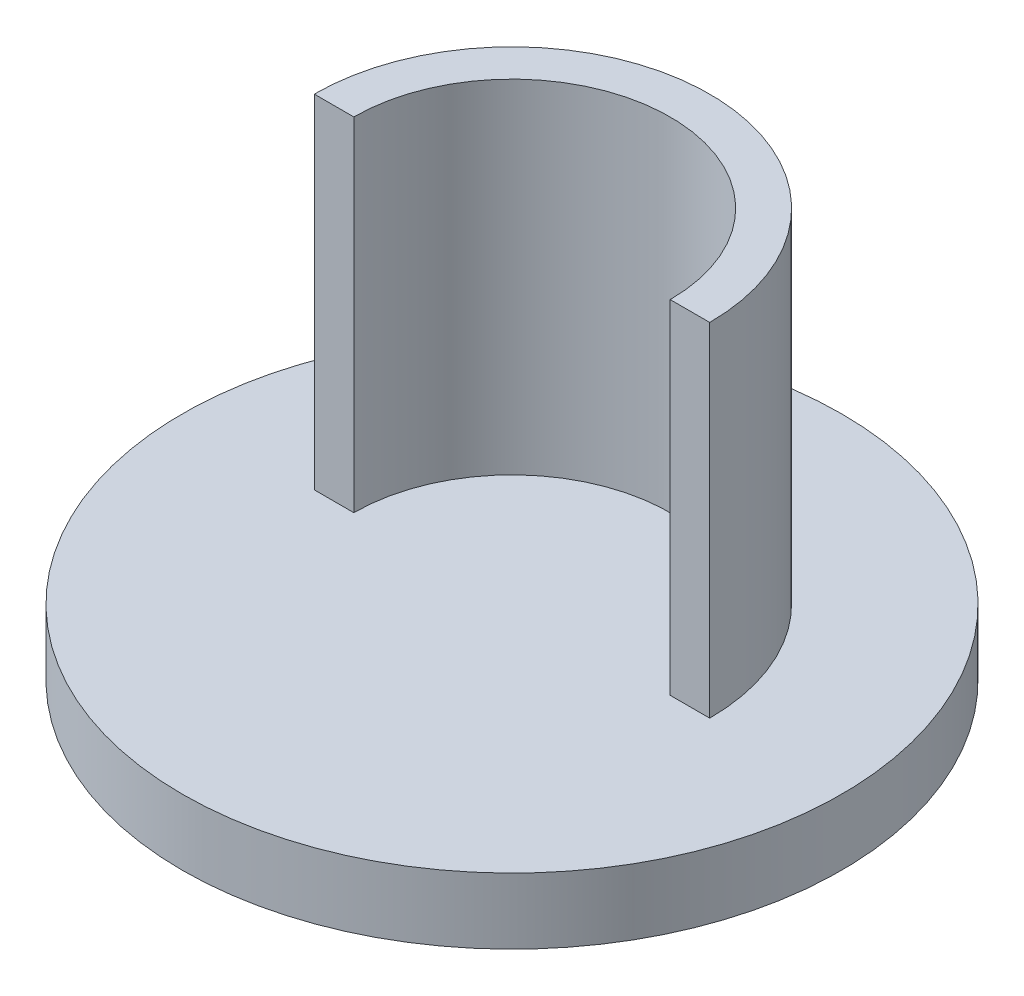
ISO-10303-21;
HEADER;
FILE_DESCRIPTION(('STEP AP214'),'2;1');
FILE_NAME('part.step','',(''),(''),'','','');
FILE_SCHEMA(('AUTOMOTIVE_DESIGN { 1 0 10303 214 1 1 1 1 }'));
ENDSEC;
DATA;
#1=APPLICATION_CONTEXT('core data for automotive mechanical design processes');
#2=APPLICATION_PROTOCOL_DEFINITION('international standard','automotive_design',2000,#1);
#3=PRODUCT_CONTEXT('',#1,'mechanical');
#4=PRODUCT('Part','Part','',(#3));
#5=PRODUCT_RELATED_PRODUCT_CATEGORY('part','',(#4));
#6=PRODUCT_DEFINITION_FORMATION('','',#4);
#7=PRODUCT_DEFINITION_CONTEXT('part definition',#1,'design');
#8=PRODUCT_DEFINITION('design','',#6,#7);
#9=PRODUCT_DEFINITION_SHAPE('','',#8);
#10=(LENGTH_UNIT() NAMED_UNIT(*) SI_UNIT(.MILLI.,.METRE.));
#11=(NAMED_UNIT(*) PLANE_ANGLE_UNIT() SI_UNIT($,.RADIAN.));
#12=(NAMED_UNIT(*) SI_UNIT($,.STERADIAN.) SOLID_ANGLE_UNIT());
#13=UNCERTAINTY_MEASURE_WITH_UNIT(LENGTH_MEASURE(1.E-05),#10,'distance_accuracy_value','');
#14=(GEOMETRIC_REPRESENTATION_CONTEXT(3) GLOBAL_UNCERTAINTY_ASSIGNED_CONTEXT((#13)) GLOBAL_UNIT_ASSIGNED_CONTEXT((#10,
#11,#12)) REPRESENTATION_CONTEXT('',''));
#15=CARTESIAN_POINT('',(0.,0.,0.));
#16=DIRECTION('',(0.,0.,1.));
#17=DIRECTION('',(1.,0.,0.));
#18=AXIS2_PLACEMENT_3D('',#15,#16,#17);
#19=CARTESIAN_POINT('',(0.,5.,0.));
#20=DIRECTION('',(0.,1.,0.));
#21=DIRECTION('',(0.,0.,1.));
#22=AXIS2_PLACEMENT_3D('',#19,#20,#21);
#23=PLANE('',#22);
#24=CARTESIAN_POINT('',(0.,5.,0.));
#25=DIRECTION('',(0.,1.,0.));
#26=DIRECTION('',(0.,0.,1.));
#27=AXIS2_PLACEMENT_3D('',#24,#25,#26);
#28=CIRCLE('',#27,25.);
#29=CARTESIAN_POINT('',(0.,5.,25.));
#30=VERTEX_POINT('',#29);
#31=EDGE_CURVE('E11',#30,#30,#28,.T.);
#32=ORIENTED_EDGE('',*,*,#31,.T.);
#33=EDGE_LOOP('',(#32));
#34=FACE_BOUND('',#33,.T.);
#35=DIRECTION('',(-1.,0.,0.));
#36=VECTOR('',#35,1.);
#37=CARTESIAN_POINT('',(15.,5.,0.));
#38=LINE('',#37,#36);
#39=CARTESIAN_POINT('',(15.,5.,0.));
#40=VERTEX_POINT('',#39);
#41=CARTESIAN_POINT('',(12.,5.,0.));
#42=VERTEX_POINT('',#41);
#43=EDGE_CURVE('E48',#40,#42,#38,.T.);
#44=ORIENTED_EDGE('',*,*,#43,.T.);
#45=CARTESIAN_POINT('',(0.,5.,0.));
#46=DIRECTION('',(0.,1.,0.));
#47=DIRECTION('',(-1.,0.,0.));
#48=AXIS2_PLACEMENT_3D('',#45,#46,#47);
#49=CIRCLE('',#48,12.);
#50=CARTESIAN_POINT('',(-12.,5.,0.));
#51=VERTEX_POINT('',#50);
#52=EDGE_CURVE('E71',#51,#42,#49,.F.);
#53=ORIENTED_EDGE('',*,*,#52,.F.);
#54=DIRECTION('',(-1.,0.,0.));
#55=VECTOR('',#54,1.);
#56=CARTESIAN_POINT('',(-12.,5.,0.));
#57=LINE('',#56,#55);
#58=CARTESIAN_POINT('',(-15.,5.,0.));
#59=VERTEX_POINT('',#58);
#60=EDGE_CURVE('E74',#51,#59,#57,.T.);
#61=ORIENTED_EDGE('',*,*,#60,.T.);
#62=CARTESIAN_POINT('',(0.,5.,0.));
#63=DIRECTION('',(0.,-1.,0.));
#64=DIRECTION('',(0.,0.,-1.));
#65=AXIS2_PLACEMENT_3D('',#62,#63,#64);
#66=CIRCLE('',#65,15.);
#67=EDGE_CURVE('E53',#59,#40,#66,.T.);
#68=ORIENTED_EDGE('',*,*,#67,.T.);
#69=EDGE_LOOP('',(#44,#53,#61,#68));
#70=FACE_BOUND('',#69,.T.);
#71=ADVANCED_FACE('F33',(#34,#70),#23,.T.);
#72=CARTESIAN_POINT('',(0.,5.,0.));
#73=DIRECTION('',(0.,-1.,0.));
#74=DIRECTION('',(0.,0.,-1.));
#75=AXIS2_PLACEMENT_3D('',#72,#73,#74);
#76=CYLINDRICAL_SURFACE('',#75,25.);
#77=ORIENTED_EDGE('',*,*,#31,.F.);
#78=EDGE_LOOP('',(#77));
#79=FACE_BOUND('',#78,.T.);
#80=CARTESIAN_POINT('',(0.,0.,0.));
#81=DIRECTION('',(0.,1.,0.));
#82=DIRECTION('',(0.,0.,1.));
#83=AXIS2_PLACEMENT_3D('',#80,#81,#82);
#84=CIRCLE('',#83,25.);
#85=CARTESIAN_POINT('',(0.,0.,25.));
#86=VERTEX_POINT('',#85);
#87=EDGE_CURVE('E41',#86,#86,#84,.T.);
#88=ORIENTED_EDGE('',*,*,#87,.T.);
#89=EDGE_LOOP('',(#88));
#90=FACE_BOUND('',#89,.T.);
#91=ADVANCED_FACE('F35',(#79,#90),#76,.T.);
#92=CARTESIAN_POINT('',(0.,0.,0.));
#93=DIRECTION('',(0.,1.,0.));
#94=DIRECTION('',(0.,0.,1.));
#95=AXIS2_PLACEMENT_3D('',#92,#93,#94);
#96=PLANE('',#95);
#97=ORIENTED_EDGE('',*,*,#87,.F.);
#98=EDGE_LOOP('',(#97));
#99=FACE_BOUND('',#98,.T.);
#100=ADVANCED_FACE('F110',(#99),#96,.F.);
#101=CARTESIAN_POINT('',(0.,31.,0.));
#102=DIRECTION('',(0.,-1.,0.));
#103=DIRECTION('',(0.,0.,-1.));
#104=AXIS2_PLACEMENT_3D('',#101,#102,#103);
#105=CYLINDRICAL_SURFACE('',#104,12.);
#106=ORIENTED_EDGE('',*,*,#52,.T.);
#107=DIRECTION('',(0.,-1.,0.));
#108=VECTOR('',#107,1.);
#109=CARTESIAN_POINT('',(12.,31.,0.));
#110=LINE('',#109,#108);
#111=CARTESIAN_POINT('',(12.,31.,0.));
#112=VERTEX_POINT('',#111);
#113=EDGE_CURVE('E105',#112,#42,#110,.T.);
#114=ORIENTED_EDGE('',*,*,#113,.F.);
#115=CARTESIAN_POINT('',(0.,31.,0.));
#116=DIRECTION('',(0.,1.,0.));
#117=DIRECTION('',(-1.,0.,0.));
#118=AXIS2_PLACEMENT_3D('',#115,#116,#117);
#119=CIRCLE('',#118,12.);
#120=CARTESIAN_POINT('',(-12.,31.,0.));
#121=VERTEX_POINT('',#120);
#122=EDGE_CURVE('E82',#121,#112,#119,.F.);
#123=ORIENTED_EDGE('',*,*,#122,.F.);
#124=DIRECTION('',(0.,-1.,0.));
#125=VECTOR('',#124,1.);
#126=CARTESIAN_POINT('',(-12.,31.,0.));
#127=LINE('',#126,#125);
#128=EDGE_CURVE('E80',#121,#51,#127,.T.);
#129=ORIENTED_EDGE('',*,*,#128,.T.);
#130=EDGE_LOOP('',(#106,#114,#123,#129));
#131=FACE_BOUND('',#130,.T.);
#132=ADVANCED_FACE('F81',(#131),#105,.F.);
#133=CARTESIAN_POINT('',(15.,31.,0.));
#134=DIRECTION('',(0.,0.,1.));
#135=DIRECTION('',(1.,0.,0.));
#136=AXIS2_PLACEMENT_3D('',#133,#134,#135);
#137=PLANE('',#136);
#138=ORIENTED_EDGE('',*,*,#43,.F.);
#139=DIRECTION('',(0.,-1.,0.));
#140=VECTOR('',#139,1.);
#141=CARTESIAN_POINT('',(15.,31.,0.));
#142=LINE('',#141,#140);
#143=CARTESIAN_POINT('',(15.,31.,0.));
#144=VERTEX_POINT('',#143);
#145=EDGE_CURVE('E103',#144,#40,#142,.T.);
#146=ORIENTED_EDGE('',*,*,#145,.F.);
#147=DIRECTION('',(-1.,0.,0.));
#148=VECTOR('',#147,1.);
#149=CARTESIAN_POINT('',(15.,31.,0.));
#150=LINE('',#149,#148);
#151=EDGE_CURVE('E91',#144,#112,#150,.T.);
#152=ORIENTED_EDGE('',*,*,#151,.T.);
#153=ORIENTED_EDGE('',*,*,#113,.T.);
#154=EDGE_LOOP('',(#138,#146,#152,#153));
#155=FACE_BOUND('',#154,.T.);
#156=ADVANCED_FACE('F117',(#155),#137,.T.);
#157=CARTESIAN_POINT('',(0.,31.,0.));
#158=DIRECTION('',(0.,-1.,0.));
#159=DIRECTION('',(0.,0.,-1.));
#160=AXIS2_PLACEMENT_3D('',#157,#158,#159);
#161=CYLINDRICAL_SURFACE('',#160,15.);
#162=ORIENTED_EDGE('',*,*,#67,.F.);
#163=DIRECTION('',(0.,-1.,0.));
#164=VECTOR('',#163,1.);
#165=CARTESIAN_POINT('',(-15.,31.,0.));
#166=LINE('',#165,#164);
#167=CARTESIAN_POINT('',(-15.,31.,0.));
#168=VERTEX_POINT('',#167);
#169=EDGE_CURVE('E86',#168,#59,#166,.T.);
#170=ORIENTED_EDGE('',*,*,#169,.F.);
#171=CARTESIAN_POINT('',(0.,31.,0.));
#172=DIRECTION('',(0.,-1.,0.));
#173=DIRECTION('',(0.,0.,-1.));
#174=AXIS2_PLACEMENT_3D('',#171,#172,#173);
#175=CIRCLE('',#174,15.);
#176=EDGE_CURVE('E98',#168,#144,#175,.T.);
#177=ORIENTED_EDGE('',*,*,#176,.T.);
#178=ORIENTED_EDGE('',*,*,#145,.T.);
#179=EDGE_LOOP('',(#162,#170,#177,#178));
#180=FACE_BOUND('',#179,.T.);
#181=ADVANCED_FACE('F150',(#180),#161,.T.);
#182=CARTESIAN_POINT('',(-12.,31.,0.));
#183=DIRECTION('',(0.,0.,1.));
#184=DIRECTION('',(1.,0.,0.));
#185=AXIS2_PLACEMENT_3D('',#182,#183,#184);
#186=PLANE('',#185);
#187=ORIENTED_EDGE('',*,*,#60,.F.);
#188=ORIENTED_EDGE('',*,*,#128,.F.);
#189=DIRECTION('',(-1.,0.,0.));
#190=VECTOR('',#189,1.);
#191=CARTESIAN_POINT('',(-12.,31.,0.));
#192=LINE('',#191,#190);
#193=EDGE_CURVE('E87',#121,#168,#192,.T.);
#194=ORIENTED_EDGE('',*,*,#193,.T.);
#195=ORIENTED_EDGE('',*,*,#169,.T.);
#196=EDGE_LOOP('',(#187,#188,#194,#195));
#197=FACE_BOUND('',#196,.T.);
#198=ADVANCED_FACE('F89',(#197),#186,.T.);
#199=CARTESIAN_POINT('',(0.,31.,0.));
#200=DIRECTION('',(0.,1.,0.));
#201=DIRECTION('',(0.,0.,1.));
#202=AXIS2_PLACEMENT_3D('',#199,#200,#201);
#203=PLANE('',#202);
#204=ORIENTED_EDGE('',*,*,#122,.T.);
#205=ORIENTED_EDGE('',*,*,#151,.F.);
#206=ORIENTED_EDGE('',*,*,#176,.F.);
#207=ORIENTED_EDGE('',*,*,#193,.F.);
#208=EDGE_LOOP('',(#204,#205,#206,#207));
#209=FACE_BOUND('',#208,.T.);
#210=ADVANCED_FACE('F167',(#209),#203,.T.);
#211=CLOSED_SHELL('',(#71,#91,#100,#132,#156,#181,#198,#210));
#212=MANIFOLD_SOLID_BREP('B2',#211);
#213=ADVANCED_BREP_SHAPE_REPRESENTATION('',(#18,#212),#14);
#214=SHAPE_DEFINITION_REPRESENTATION(#9,#213);
ENDSEC;
END-ISO-10303-21;
